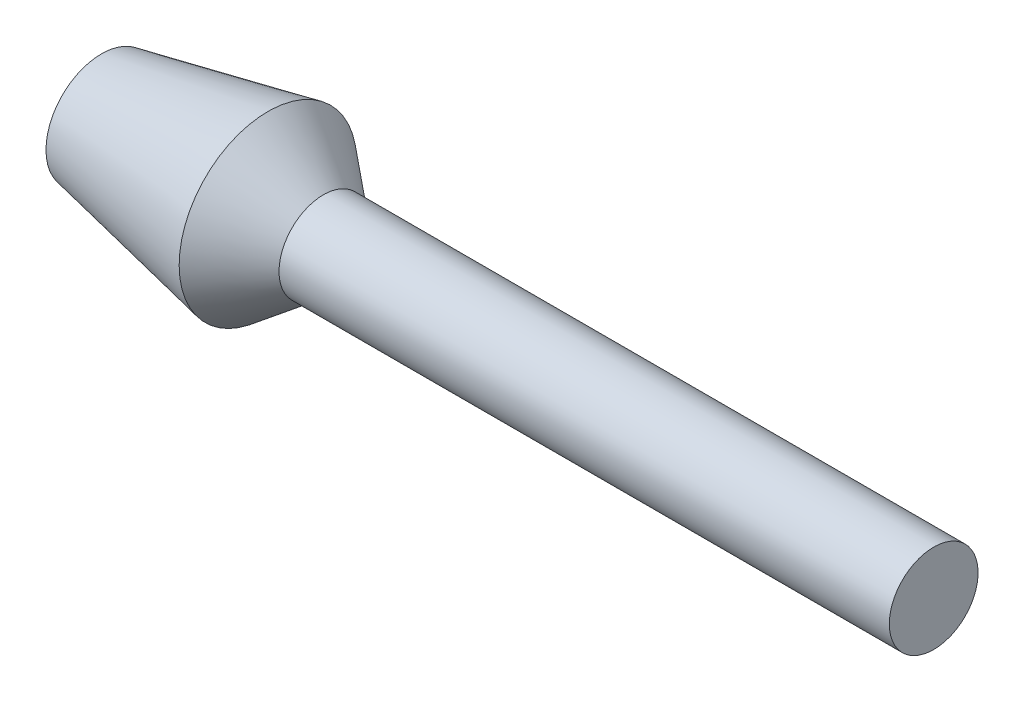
ISO-10303-21;
HEADER;
FILE_DESCRIPTION(('STEP AP214'),'2;1');
FILE_NAME('part.step','',(''),(''),'','','');
FILE_SCHEMA(('AUTOMOTIVE_DESIGN { 1 0 10303 214 1 1 1 1 }'));
ENDSEC;
DATA;
#1=APPLICATION_CONTEXT('core data for automotive mechanical design processes');
#2=APPLICATION_PROTOCOL_DEFINITION('international standard','automotive_design',2000,#1);
#3=PRODUCT_CONTEXT('',#1,'mechanical');
#4=PRODUCT('Part','Part','',(#3));
#5=PRODUCT_RELATED_PRODUCT_CATEGORY('part','',(#4));
#6=PRODUCT_DEFINITION_FORMATION('','',#4);
#7=PRODUCT_DEFINITION_CONTEXT('part definition',#1,'design');
#8=PRODUCT_DEFINITION('design','',#6,#7);
#9=PRODUCT_DEFINITION_SHAPE('','',#8);
#10=(LENGTH_UNIT() NAMED_UNIT(*) SI_UNIT(.MILLI.,.METRE.));
#11=(NAMED_UNIT(*) PLANE_ANGLE_UNIT() SI_UNIT($,.RADIAN.));
#12=(NAMED_UNIT(*) SI_UNIT($,.STERADIAN.) SOLID_ANGLE_UNIT());
#13=UNCERTAINTY_MEASURE_WITH_UNIT(LENGTH_MEASURE(1.E-05),#10,'distance_accuracy_value','');
#14=(GEOMETRIC_REPRESENTATION_CONTEXT(3) GLOBAL_UNCERTAINTY_ASSIGNED_CONTEXT((#13)) GLOBAL_UNIT_ASSIGNED_CONTEXT((#10,
#11,#12)) REPRESENTATION_CONTEXT('',''));
#15=CARTESIAN_POINT('',(0.,0.,0.));
#16=DIRECTION('',(0.,0.,1.));
#17=DIRECTION('',(1.,0.,0.));
#18=AXIS2_PLACEMENT_3D('',#15,#16,#17);
#19=CARTESIAN_POINT('',(51.8674698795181,0.,0.));
#20=DIRECTION('',(1.,0.,0.));
#21=DIRECTION('',(0.,0.,-1.));
#22=AXIS2_PLACEMENT_3D('',#19,#20,#21);
#23=PLANE('',#22);
#24=CARTESIAN_POINT('',(51.867469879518,0.,0.));
#25=DIRECTION('',(-1.,0.,0.));
#26=DIRECTION('',(0.,0.,1.));
#27=AXIS2_PLACEMENT_3D('',#24,#25,#26);
#28=CIRCLE('',#27,4.);
#29=CARTESIAN_POINT('',(51.867469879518,0.,4.));
#30=VERTEX_POINT('',#29);
#31=EDGE_CURVE('E10',#30,#30,#28,.T.);
#32=ORIENTED_EDGE('',*,*,#31,.F.);
#33=EDGE_LOOP('',(#32));
#34=FACE_BOUND('',#33,.T.);
#35=ADVANCED_FACE('F33',(#34),#23,.T.);
#36=CARTESIAN_POINT('',(-23.1325301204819,0.,0.));
#37=DIRECTION('',(-1.,0.,0.));
#38=DIRECTION('',(0.,0.,1.));
#39=AXIS2_PLACEMENT_3D('',#36,#37,#38);
#40=CYLINDRICAL_SURFACE('',#39,4.);
#41=ORIENTED_EDGE('',*,*,#31,.T.);
#42=EDGE_LOOP('',(#41));
#43=FACE_BOUND('',#42,.T.);
#44=CARTESIAN_POINT('',(-3.13253012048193,0.,0.));
#45=DIRECTION('',(-1.,0.,0.));
#46=DIRECTION('',(0.,0.,1.));
#47=AXIS2_PLACEMENT_3D('',#44,#45,#46);
#48=CIRCLE('',#47,4.00000000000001);
#49=CARTESIAN_POINT('',(-3.13253012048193,0.,4.00000000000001));
#50=VERTEX_POINT('',#49);
#51=EDGE_CURVE('E39',#50,#50,#48,.T.);
#52=ORIENTED_EDGE('',*,*,#51,.F.);
#53=EDGE_LOOP('',(#52));
#54=FACE_BOUND('',#53,.T.);
#55=ADVANCED_FACE('F65',(#43,#54),#40,.T.);
#56=CARTESIAN_POINT('',(-8.13253012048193,0.,0.));
#57=DIRECTION('',(-1.,0.,0.));
#58=DIRECTION('',(0.,0.,1.));
#59=AXIS2_PLACEMENT_3D('',#56,#57,#58);
#60=CONICAL_SURFACE('',#59,8.,0.674740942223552);
#61=ORIENTED_EDGE('',*,*,#51,.T.);
#62=EDGE_LOOP('',(#61));
#63=FACE_BOUND('',#62,.T.);
#64=CARTESIAN_POINT('',(-8.13253012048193,0.,0.));
#65=DIRECTION('',(-1.,0.,0.));
#66=DIRECTION('',(0.,0.,1.));
#67=AXIS2_PLACEMENT_3D('',#64,#65,#66);
#68=CIRCLE('',#67,8.);
#69=CARTESIAN_POINT('',(-8.13253012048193,0.,8.));
#70=VERTEX_POINT('',#69);
#71=EDGE_CURVE('E43',#70,#70,#68,.T.);
#72=ORIENTED_EDGE('',*,*,#71,.F.);
#73=EDGE_LOOP('',(#72));
#74=FACE_BOUND('',#73,.T.);
#75=ADVANCED_FACE('F57',(#63,#74),#60,.T.);
#76=CARTESIAN_POINT('',(-23.1325301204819,0.,0.));
#77=DIRECTION('',(1.,0.,0.));
#78=DIRECTION('',(0.,0.,-1.));
#79=AXIS2_PLACEMENT_3D('',#76,#77,#78);
#80=CONICAL_SURFACE('',#79,5.,0.197395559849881);
#81=ORIENTED_EDGE('',*,*,#71,.T.);
#82=EDGE_LOOP('',(#81));
#83=FACE_BOUND('',#82,.T.);
#84=CARTESIAN_POINT('',(-23.1325301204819,0.,0.));
#85=DIRECTION('',(-1.,0.,0.));
#86=DIRECTION('',(0.,0.,1.));
#87=AXIS2_PLACEMENT_3D('',#84,#85,#86);
#88=CIRCLE('',#87,5.);
#89=CARTESIAN_POINT('',(-23.1325301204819,0.,5.));
#90=VERTEX_POINT('',#89);
#91=EDGE_CURVE('E47',#90,#90,#88,.T.);
#92=ORIENTED_EDGE('',*,*,#91,.F.);
#93=EDGE_LOOP('',(#92));
#94=FACE_BOUND('',#93,.T.);
#95=ADVANCED_FACE('F55',(#83,#94),#80,.T.);
#96=CARTESIAN_POINT('',(-23.1325301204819,-5.,0.));
#97=DIRECTION('',(-1.,0.,0.));
#98=DIRECTION('',(0.,0.,1.));
#99=AXIS2_PLACEMENT_3D('',#96,#97,#98);
#100=PLANE('',#99);
#101=ORIENTED_EDGE('',*,*,#91,.T.);
#102=EDGE_LOOP('',(#101));
#103=FACE_BOUND('',#102,.T.);
#104=ADVANCED_FACE('F53',(#103),#100,.T.);
#105=CLOSED_SHELL('',(#35,#55,#75,#95,#104));
#106=MANIFOLD_SOLID_BREP('B2',#105);
#107=ADVANCED_BREP_SHAPE_REPRESENTATION('',(#18,#106),#14);
#108=SHAPE_DEFINITION_REPRESENTATION(#9,#107);
ENDSEC;
END-ISO-10303-21;
